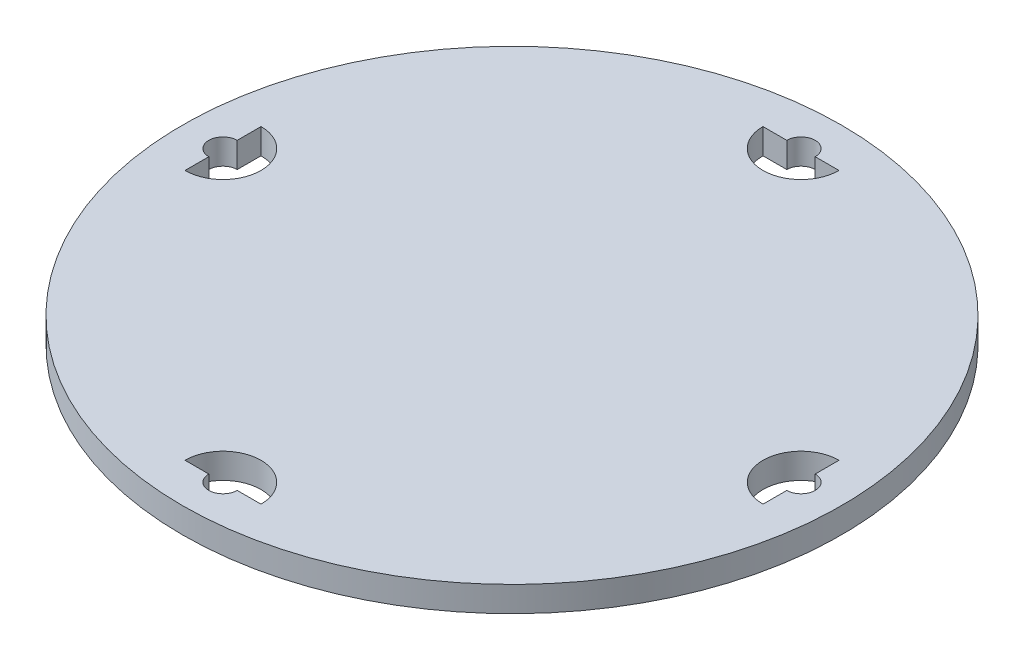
ISO-10303-21;
HEADER;
FILE_DESCRIPTION(('STEP AP214'),'2;1');
FILE_NAME('part.step','',(''),(''),'','','');
FILE_SCHEMA(('AUTOMOTIVE_DESIGN { 1 0 10303 214 1 1 1 1 }'));
ENDSEC;
DATA;
#1=APPLICATION_CONTEXT('core data for automotive mechanical design processes');
#2=APPLICATION_PROTOCOL_DEFINITION('international standard','automotive_design',2000,#1);
#3=PRODUCT_CONTEXT('',#1,'mechanical');
#4=PRODUCT('Part','Part','',(#3));
#5=PRODUCT_RELATED_PRODUCT_CATEGORY('part','',(#4));
#6=PRODUCT_DEFINITION_FORMATION('','',#4);
#7=PRODUCT_DEFINITION_CONTEXT('part definition',#1,'design');
#8=PRODUCT_DEFINITION('design','',#6,#7);
#9=PRODUCT_DEFINITION_SHAPE('','',#8);
#10=(LENGTH_UNIT() NAMED_UNIT(*) SI_UNIT(.MILLI.,.METRE.));
#11=(NAMED_UNIT(*) PLANE_ANGLE_UNIT() SI_UNIT($,.RADIAN.));
#12=(NAMED_UNIT(*) SI_UNIT($,.STERADIAN.) SOLID_ANGLE_UNIT());
#13=UNCERTAINTY_MEASURE_WITH_UNIT(LENGTH_MEASURE(1.E-05),#10,'distance_accuracy_value','');
#14=(GEOMETRIC_REPRESENTATION_CONTEXT(3) GLOBAL_UNCERTAINTY_ASSIGNED_CONTEXT((#13)) GLOBAL_UNIT_ASSIGNED_CONTEXT((#10,
#11,#12)) REPRESENTATION_CONTEXT('',''));
#15=CARTESIAN_POINT('',(0.,0.,0.));
#16=DIRECTION('',(0.,0.,1.));
#17=DIRECTION('',(1.,0.,0.));
#18=AXIS2_PLACEMENT_3D('',#15,#16,#17);
#19=CARTESIAN_POINT('',(0.,6.35,0.));
#20=DIRECTION('',(0.,1.,0.));
#21=DIRECTION('',(0.,0.,1.));
#22=AXIS2_PLACEMENT_3D('',#19,#20,#21);
#23=PLANE('',#22);
#24=DIRECTION('',(1.,0.,0.));
#25=VECTOR('',#24,1.);
#26=CARTESIAN_POINT('',(1.68305086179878E-13,6.35,-72.39));
#27=LINE('',#26,#25);
#28=CARTESIAN_POINT('',(3.556,6.35,-72.39));
#29=VERTEX_POINT('',#28);
#30=CARTESIAN_POINT('',(9.525,6.35,-72.39));
#31=VERTEX_POINT('',#30);
#32=EDGE_CURVE('E81',#29,#31,#27,.T.);
#33=ORIENTED_EDGE('',*,*,#32,.T.);
#34=CARTESIAN_POINT('',(0.,6.35,-72.39));
#35=DIRECTION('',(0.,1.,0.));
#36=DIRECTION('',(0.,0.,-1.));
#37=AXIS2_PLACEMENT_3D('',#34,#35,#36);
#38=CIRCLE('',#37,9.525);
#39=CARTESIAN_POINT('',(-9.525,6.35,-72.39));
#40=VERTEX_POINT('',#39);
#41=EDGE_CURVE('E233',#31,#40,#38,.F.);
#42=ORIENTED_EDGE('',*,*,#41,.T.);
#43=DIRECTION('',(-1.,0.,0.));
#44=VECTOR('',#43,1.);
#45=CARTESIAN_POINT('',(-1.68305086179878E-13,6.35,-72.39));
#46=LINE('',#45,#44);
#47=CARTESIAN_POINT('',(-3.556,6.35,-72.39));
#48=VERTEX_POINT('',#47);
#49=EDGE_CURVE('E221',#48,#40,#46,.T.);
#50=ORIENTED_EDGE('',*,*,#49,.F.);
#51=CARTESIAN_POINT('',(0.,6.35,-72.39));
#52=DIRECTION('',(0.,1.,0.));
#53=DIRECTION('',(0.,0.,-1.));
#54=AXIS2_PLACEMENT_3D('',#51,#52,#53);
#55=CIRCLE('',#54,3.556);
#56=EDGE_CURVE('E210',#29,#48,#55,.T.);
#57=ORIENTED_EDGE('',*,*,#56,.F.);
#58=EDGE_LOOP('',(#33,#42,#50,#57));
#59=FACE_BOUND('',#58,.T.);
#60=CARTESIAN_POINT('',(0.,6.35,72.39));
#61=DIRECTION('',(0.,1.,0.));
#62=DIRECTION('',(0.,0.,1.));
#63=AXIS2_PLACEMENT_3D('',#60,#61,#62);
#64=CIRCLE('',#63,9.525);
#65=CARTESIAN_POINT('',(-9.525,6.35,72.39));
#66=VERTEX_POINT('',#65);
#67=CARTESIAN_POINT('',(9.525,6.35,72.39));
#68=VERTEX_POINT('',#67);
#69=EDGE_CURVE('E274',#66,#68,#64,.F.);
#70=ORIENTED_EDGE('',*,*,#69,.T.);
#71=DIRECTION('',(1.,0.,0.));
#72=VECTOR('',#71,1.);
#73=CARTESIAN_POINT('',(1.68305086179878E-13,6.35,72.39));
#74=LINE('',#73,#72);
#75=CARTESIAN_POINT('',(3.556,6.35,72.39));
#76=VERTEX_POINT('',#75);
#77=EDGE_CURVE('E296',#76,#68,#74,.T.);
#78=ORIENTED_EDGE('',*,*,#77,.F.);
#79=CARTESIAN_POINT('',(0.,6.35,72.39));
#80=DIRECTION('',(0.,1.,0.));
#81=DIRECTION('',(0.,0.,1.));
#82=AXIS2_PLACEMENT_3D('',#79,#80,#81);
#83=CIRCLE('',#82,3.556);
#84=CARTESIAN_POINT('',(-3.556,6.35,72.39));
#85=VERTEX_POINT('',#84);
#86=EDGE_CURVE('E275',#85,#76,#83,.T.);
#87=ORIENTED_EDGE('',*,*,#86,.F.);
#88=DIRECTION('',(-1.,0.,0.));
#89=VECTOR('',#88,1.);
#90=CARTESIAN_POINT('',(-1.68305086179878E-13,6.35,72.39));
#91=LINE('',#90,#89);
#92=EDGE_CURVE('E271',#85,#66,#91,.T.);
#93=ORIENTED_EDGE('',*,*,#92,.T.);
#94=EDGE_LOOP('',(#70,#78,#87,#93));
#95=FACE_BOUND('',#94,.T.);
#96=CARTESIAN_POINT('',(0.,6.35,0.));
#97=DIRECTION('',(0.,1.,0.));
#98=DIRECTION('',(0.,0.,1.));
#99=AXIS2_PLACEMENT_3D('',#96,#97,#98);
#100=CIRCLE('',#99,82.55);
#101=CARTESIAN_POINT('',(0.,6.35,82.55));
#102=VERTEX_POINT('',#101);
#103=EDGE_CURVE('E12',#102,#102,#100,.T.);
#104=ORIENTED_EDGE('',*,*,#103,.T.);
#105=EDGE_LOOP('',(#104));
#106=FACE_BOUND('',#105,.T.);
#107=DIRECTION('',(0.,0.,-1.));
#108=VECTOR('',#107,1.);
#109=CARTESIAN_POINT('',(-72.39,6.35,5.89939916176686E-13));
#110=LINE('',#109,#108);
#111=CARTESIAN_POINT('',(-72.3900000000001,6.35,-3.55599999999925));
#112=VERTEX_POINT('',#111);
#113=CARTESIAN_POINT('',(-72.3900000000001,6.35,-9.52499999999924));
#114=VERTEX_POINT('',#113);
#115=EDGE_CURVE('E213',#112,#114,#110,.T.);
#116=ORIENTED_EDGE('',*,*,#115,.T.);
#117=CARTESIAN_POINT('',(-72.39,6.35,7.58245002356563E-13));
#118=DIRECTION('',(0.,1.,0.));
#119=DIRECTION('',(-1.,0.,0.));
#120=AXIS2_PLACEMENT_3D('',#117,#118,#119);
#121=CIRCLE('',#120,9.525);
#122=CARTESIAN_POINT('',(-72.3899999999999,6.35,9.52500000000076));
#123=VERTEX_POINT('',#122);
#124=EDGE_CURVE('E263',#114,#123,#121,.F.);
#125=ORIENTED_EDGE('',*,*,#124,.T.);
#126=DIRECTION('',(0.,0.,1.));
#127=VECTOR('',#126,1.);
#128=CARTESIAN_POINT('',(-72.39,6.35,9.26550088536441E-13));
#129=LINE('',#128,#127);
#130=CARTESIAN_POINT('',(-72.39,6.35,3.55600000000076));
#131=VERTEX_POINT('',#130);
#132=EDGE_CURVE('E251',#131,#123,#129,.T.);
#133=ORIENTED_EDGE('',*,*,#132,.F.);
#134=CARTESIAN_POINT('',(-72.39,6.35,7.58245002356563E-13));
#135=DIRECTION('',(0.,1.,0.));
#136=DIRECTION('',(-1.,0.,0.));
#137=AXIS2_PLACEMENT_3D('',#134,#135,#136);
#138=CIRCLE('',#137,3.556);
#139=EDGE_CURVE('E240',#112,#131,#138,.T.);
#140=ORIENTED_EDGE('',*,*,#139,.F.);
#141=EDGE_LOOP('',(#116,#125,#133,#140));
#142=FACE_BOUND('',#141,.T.);
#143=DIRECTION('',(0.,0.,1.));
#144=VECTOR('',#143,1.);
#145=CARTESIAN_POINT('',(72.39,6.35,0.));
#146=LINE('',#145,#144);
#147=CARTESIAN_POINT('',(72.39,6.35,3.55599999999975));
#148=VERTEX_POINT('',#147);
#149=CARTESIAN_POINT('',(72.39,6.35,9.52499999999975));
#150=VERTEX_POINT('',#149);
#151=EDGE_CURVE('E73',#148,#150,#146,.T.);
#152=ORIENTED_EDGE('',*,*,#151,.T.);
#153=CARTESIAN_POINT('',(72.39,6.35,-2.52748334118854E-13));
#154=DIRECTION('',(0.,1.,0.));
#155=DIRECTION('',(1.,0.,0.));
#156=AXIS2_PLACEMENT_3D('',#153,#154,#155);
#157=CIRCLE('',#156,9.525);
#158=CARTESIAN_POINT('',(72.39,6.35,-9.52500000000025));
#159=VERTEX_POINT('',#158);
#160=EDGE_CURVE('E192',#150,#159,#157,.F.);
#161=ORIENTED_EDGE('',*,*,#160,.T.);
#162=DIRECTION('',(0.,0.,-1.));
#163=VECTOR('',#162,1.);
#164=CARTESIAN_POINT('',(72.39,6.35,-4.21053420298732E-13));
#165=LINE('',#164,#163);
#166=CARTESIAN_POINT('',(72.39,6.35,-3.55600000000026));
#167=VERTEX_POINT('',#166);
#168=EDGE_CURVE('E185',#167,#159,#165,.T.);
#169=ORIENTED_EDGE('',*,*,#168,.F.);
#170=CARTESIAN_POINT('',(72.39,6.35,-2.52748334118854E-13));
#171=DIRECTION('',(0.,1.,0.));
#172=DIRECTION('',(1.,0.,0.));
#173=AXIS2_PLACEMENT_3D('',#170,#171,#172);
#174=CIRCLE('',#173,3.556);
#175=EDGE_CURVE('E173',#148,#167,#174,.T.);
#176=ORIENTED_EDGE('',*,*,#175,.F.);
#177=EDGE_LOOP('',(#152,#161,#169,#176));
#178=FACE_BOUND('',#177,.T.);
#179=ADVANCED_FACE('F58',(#59,#95,#106,#142,#178),#23,.T.);
#180=CARTESIAN_POINT('',(0.,0.,0.));
#181=DIRECTION('',(0.,1.,0.));
#182=DIRECTION('',(0.,0.,1.));
#183=AXIS2_PLACEMENT_3D('',#180,#181,#182);
#184=PLANE('',#183);
#185=CARTESIAN_POINT('',(0.,0.,0.));
#186=DIRECTION('',(0.,1.,0.));
#187=DIRECTION('',(0.,0.,1.));
#188=AXIS2_PLACEMENT_3D('',#185,#186,#187);
#189=CIRCLE('',#188,82.55);
#190=CARTESIAN_POINT('',(0.,0.,82.55));
#191=VERTEX_POINT('',#190);
#192=EDGE_CURVE('E62',#191,#191,#189,.T.);
#193=ORIENTED_EDGE('',*,*,#192,.F.);
#194=EDGE_LOOP('',(#193));
#195=FACE_BOUND('',#194,.T.);
#196=DIRECTION('',(1.,0.,0.));
#197=VECTOR('',#196,1.);
#198=CARTESIAN_POINT('',(1.68305086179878E-13,0.,72.39));
#199=LINE('',#198,#197);
#200=CARTESIAN_POINT('',(3.556,0.,72.39));
#201=VERTEX_POINT('',#200);
#202=CARTESIAN_POINT('',(9.525,0.,72.39));
#203=VERTEX_POINT('',#202);
#204=EDGE_CURVE('E284',#201,#203,#199,.T.);
#205=ORIENTED_EDGE('',*,*,#204,.T.);
#206=CARTESIAN_POINT('',(0.,0.,72.39));
#207=DIRECTION('',(0.,1.,0.));
#208=DIRECTION('',(0.,0.,1.));
#209=AXIS2_PLACEMENT_3D('',#206,#207,#208);
#210=CIRCLE('',#209,9.525);
#211=CARTESIAN_POINT('',(-9.525,0.,72.39));
#212=VERTEX_POINT('',#211);
#213=EDGE_CURVE('E278',#212,#203,#210,.F.);
#214=ORIENTED_EDGE('',*,*,#213,.F.);
#215=DIRECTION('',(-1.,0.,0.));
#216=VECTOR('',#215,1.);
#217=CARTESIAN_POINT('',(-1.68305086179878E-13,0.,72.39));
#218=LINE('',#217,#216);
#219=CARTESIAN_POINT('',(-3.556,0.,72.39));
#220=VERTEX_POINT('',#219);
#221=EDGE_CURVE('E281',#220,#212,#218,.T.);
#222=ORIENTED_EDGE('',*,*,#221,.F.);
#223=CARTESIAN_POINT('',(0.,0.,72.39));
#224=DIRECTION('',(0.,1.,0.));
#225=DIRECTION('',(0.,0.,1.));
#226=AXIS2_PLACEMENT_3D('',#223,#224,#225);
#227=CIRCLE('',#226,3.556);
#228=EDGE_CURVE('E209',#220,#201,#227,.T.);
#229=ORIENTED_EDGE('',*,*,#228,.T.);
#230=EDGE_LOOP('',(#205,#214,#222,#229));
#231=FACE_BOUND('',#230,.T.);
#232=CARTESIAN_POINT('',(-72.39,0.,7.58245002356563E-13));
#233=DIRECTION('',(0.,1.,0.));
#234=DIRECTION('',(-1.,0.,0.));
#235=AXIS2_PLACEMENT_3D('',#232,#233,#234);
#236=CIRCLE('',#235,9.525);
#237=CARTESIAN_POINT('',(-72.3900000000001,0.,-9.52499999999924));
#238=VERTEX_POINT('',#237);
#239=CARTESIAN_POINT('',(-72.3899999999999,0.,9.52500000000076));
#240=VERTEX_POINT('',#239);
#241=EDGE_CURVE('E260',#238,#240,#236,.F.);
#242=ORIENTED_EDGE('',*,*,#241,.F.);
#243=DIRECTION('',(0.,0.,-1.));
#244=VECTOR('',#243,1.);
#245=CARTESIAN_POINT('',(-72.39,0.,5.89939916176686E-13));
#246=LINE('',#245,#244);
#247=CARTESIAN_POINT('',(-72.3900000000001,0.,-3.55599999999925));
#248=VERTEX_POINT('',#247);
#249=EDGE_CURVE('E266',#248,#238,#246,.T.);
#250=ORIENTED_EDGE('',*,*,#249,.F.);
#251=CARTESIAN_POINT('',(-72.39,0.,7.58245002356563E-13));
#252=DIRECTION('',(0.,1.,0.));
#253=DIRECTION('',(-1.,0.,0.));
#254=AXIS2_PLACEMENT_3D('',#251,#252,#253);
#255=CIRCLE('',#254,3.556);
#256=CARTESIAN_POINT('',(-72.39,0.,3.55600000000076));
#257=VERTEX_POINT('',#256);
#258=EDGE_CURVE('E242',#248,#257,#255,.T.);
#259=ORIENTED_EDGE('',*,*,#258,.T.);
#260=DIRECTION('',(0.,0.,1.));
#261=VECTOR('',#260,1.);
#262=CARTESIAN_POINT('',(-72.39,0.,9.26550088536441E-13));
#263=LINE('',#262,#261);
#264=EDGE_CURVE('E255',#257,#240,#263,.T.);
#265=ORIENTED_EDGE('',*,*,#264,.T.);
#266=EDGE_LOOP('',(#242,#250,#259,#265));
#267=FACE_BOUND('',#266,.T.);
#268=CARTESIAN_POINT('',(0.,0.,-72.39));
#269=DIRECTION('',(0.,1.,0.));
#270=DIRECTION('',(0.,0.,-1.));
#271=AXIS2_PLACEMENT_3D('',#268,#269,#270);
#272=CIRCLE('',#271,9.525);
#273=CARTESIAN_POINT('',(9.525,0.,-72.39));
#274=VERTEX_POINT('',#273);
#275=CARTESIAN_POINT('',(-9.525,0.,-72.39));
#276=VERTEX_POINT('',#275);
#277=EDGE_CURVE('E230',#274,#276,#272,.F.);
#278=ORIENTED_EDGE('',*,*,#277,.F.);
#279=DIRECTION('',(1.,0.,0.));
#280=VECTOR('',#279,1.);
#281=CARTESIAN_POINT('',(1.68305086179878E-13,0.,-72.39));
#282=LINE('',#281,#280);
#283=CARTESIAN_POINT('',(3.556,0.,-72.39));
#284=VERTEX_POINT('',#283);
#285=EDGE_CURVE('E236',#284,#274,#282,.T.);
#286=ORIENTED_EDGE('',*,*,#285,.F.);
#287=CARTESIAN_POINT('',(0.,0.,-72.39));
#288=DIRECTION('',(0.,1.,0.));
#289=DIRECTION('',(0.,0.,-1.));
#290=AXIS2_PLACEMENT_3D('',#287,#288,#289);
#291=CIRCLE('',#290,3.556);
#292=CARTESIAN_POINT('',(-3.556,0.,-72.39));
#293=VERTEX_POINT('',#292);
#294=EDGE_CURVE('E212',#284,#293,#291,.T.);
#295=ORIENTED_EDGE('',*,*,#294,.T.);
#296=DIRECTION('',(-1.,0.,0.));
#297=VECTOR('',#296,1.);
#298=CARTESIAN_POINT('',(-1.68305086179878E-13,0.,-72.39));
#299=LINE('',#298,#297);
#300=EDGE_CURVE('E225',#293,#276,#299,.T.);
#301=ORIENTED_EDGE('',*,*,#300,.T.);
#302=EDGE_LOOP('',(#278,#286,#295,#301));
#303=FACE_BOUND('',#302,.T.);
#304=CARTESIAN_POINT('',(72.39,0.,-2.52748334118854E-13));
#305=DIRECTION('',(0.,1.,0.));
#306=DIRECTION('',(1.,0.,0.));
#307=AXIS2_PLACEMENT_3D('',#304,#305,#306);
#308=CIRCLE('',#307,9.525);
#309=CARTESIAN_POINT('',(72.39,0.,9.52499999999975));
#310=VERTEX_POINT('',#309);
#311=CARTESIAN_POINT('',(72.39,0.,-9.52500000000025));
#312=VERTEX_POINT('',#311);
#313=EDGE_CURVE('E201',#310,#312,#308,.F.);
#314=ORIENTED_EDGE('',*,*,#313,.F.);
#315=DIRECTION('',(0.,0.,1.));
#316=VECTOR('',#315,1.);
#317=CARTESIAN_POINT('',(72.39,0.,0.));
#318=LINE('',#317,#316);
#319=CARTESIAN_POINT('',(72.39,0.,3.55599999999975));
#320=VERTEX_POINT('',#319);
#321=EDGE_CURVE('E205',#320,#310,#318,.T.);
#322=ORIENTED_EDGE('',*,*,#321,.F.);
#323=CARTESIAN_POINT('',(72.39,0.,-2.52748334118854E-13));
#324=DIRECTION('',(0.,1.,0.));
#325=DIRECTION('',(1.,0.,0.));
#326=AXIS2_PLACEMENT_3D('',#323,#324,#325);
#327=CIRCLE('',#326,3.556);
#328=CARTESIAN_POINT('',(72.39,0.,-3.55600000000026));
#329=VERTEX_POINT('',#328);
#330=EDGE_CURVE('E181',#320,#329,#327,.T.);
#331=ORIENTED_EDGE('',*,*,#330,.T.);
#332=DIRECTION('',(0.,0.,-1.));
#333=VECTOR('',#332,1.);
#334=CARTESIAN_POINT('',(72.39,0.,-4.21053420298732E-13));
#335=LINE('',#334,#333);
#336=EDGE_CURVE('E188',#329,#312,#335,.T.);
#337=ORIENTED_EDGE('',*,*,#336,.T.);
#338=EDGE_LOOP('',(#314,#322,#331,#337));
#339=FACE_BOUND('',#338,.T.);
#340=ADVANCED_FACE('F315',(#195,#231,#267,#303,#339),#184,.F.);
#341=CARTESIAN_POINT('',(0.,6.35,0.));
#342=DIRECTION('',(0.,-1.,0.));
#343=DIRECTION('',(0.,0.,-1.));
#344=AXIS2_PLACEMENT_3D('',#341,#342,#343);
#345=CYLINDRICAL_SURFACE('',#344,82.55);
#346=ORIENTED_EDGE('',*,*,#103,.F.);
#347=EDGE_LOOP('',(#346));
#348=FACE_BOUND('',#347,.T.);
#349=ORIENTED_EDGE('',*,*,#192,.T.);
#350=EDGE_LOOP('',(#349));
#351=FACE_BOUND('',#350,.T.);
#352=ADVANCED_FACE('F60',(#348,#351),#345,.T.);
#353=CARTESIAN_POINT('',(0.,6.351,72.39));
#354=DIRECTION('',(0.,-1.,0.));
#355=DIRECTION('',(0.,0.,-1.));
#356=AXIS2_PLACEMENT_3D('',#353,#354,#355);
#357=CYLINDRICAL_SURFACE('',#356,9.525);
#358=DIRECTION('',(0.,-1.,0.));
#359=VECTOR('',#358,1.);
#360=CARTESIAN_POINT('',(-9.525,6.351,72.39));
#361=LINE('',#360,#359);
#362=EDGE_CURVE('E294',#66,#212,#361,.T.);
#363=ORIENTED_EDGE('',*,*,#362,.T.);
#364=ORIENTED_EDGE('',*,*,#213,.T.);
#365=DIRECTION('',(0.,-1.,0.));
#366=VECTOR('',#365,1.);
#367=CARTESIAN_POINT('',(9.525,6.351,72.39));
#368=LINE('',#367,#366);
#369=EDGE_CURVE('E287',#68,#203,#368,.T.);
#370=ORIENTED_EDGE('',*,*,#369,.F.);
#371=ORIENTED_EDGE('',*,*,#69,.F.);
#372=EDGE_LOOP('',(#363,#364,#370,#371));
#373=FACE_BOUND('',#372,.T.);
#374=ADVANCED_FACE('F321',(#373),#357,.F.);
#375=CARTESIAN_POINT('',(-1.68305086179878E-13,6.351,72.39));
#376=DIRECTION('',(0.,0.,1.));
#377=DIRECTION('',(1.,0.,0.));
#378=AXIS2_PLACEMENT_3D('',#375,#376,#377);
#379=PLANE('',#378);
#380=DIRECTION('',(0.,-1.,0.));
#381=VECTOR('',#380,1.);
#382=CARTESIAN_POINT('',(-3.556,6.351,72.39));
#383=LINE('',#382,#381);
#384=EDGE_CURVE('E292',#85,#220,#383,.T.);
#385=ORIENTED_EDGE('',*,*,#384,.T.);
#386=ORIENTED_EDGE('',*,*,#221,.T.);
#387=ORIENTED_EDGE('',*,*,#362,.F.);
#388=ORIENTED_EDGE('',*,*,#92,.F.);
#389=EDGE_LOOP('',(#385,#386,#387,#388));
#390=FACE_BOUND('',#389,.T.);
#391=ADVANCED_FACE('F319',(#390),#379,.F.);
#392=CARTESIAN_POINT('',(1.68305086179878E-13,6.351,72.39));
#393=DIRECTION('',(0.,0.,-1.));
#394=DIRECTION('',(-1.,0.,0.));
#395=AXIS2_PLACEMENT_3D('',#392,#393,#394);
#396=PLANE('',#395);
#397=ORIENTED_EDGE('',*,*,#77,.T.);
#398=ORIENTED_EDGE('',*,*,#369,.T.);
#399=ORIENTED_EDGE('',*,*,#204,.F.);
#400=DIRECTION('',(0.,-1.,0.));
#401=VECTOR('',#400,1.);
#402=CARTESIAN_POINT('',(3.556,6.351,72.39));
#403=LINE('',#402,#401);
#404=EDGE_CURVE('E289',#76,#201,#403,.T.);
#405=ORIENTED_EDGE('',*,*,#404,.F.);
#406=EDGE_LOOP('',(#397,#398,#399,#405));
#407=FACE_BOUND('',#406,.T.);
#408=ADVANCED_FACE('F312',(#407),#396,.T.);
#409=CARTESIAN_POINT('',(0.,6.351,72.39));
#410=DIRECTION('',(0.,-1.,0.));
#411=DIRECTION('',(0.,0.,-1.));
#412=AXIS2_PLACEMENT_3D('',#409,#410,#411);
#413=CYLINDRICAL_SURFACE('',#412,3.556);
#414=ORIENTED_EDGE('',*,*,#384,.F.);
#415=ORIENTED_EDGE('',*,*,#86,.T.);
#416=ORIENTED_EDGE('',*,*,#404,.T.);
#417=ORIENTED_EDGE('',*,*,#228,.F.);
#418=EDGE_LOOP('',(#414,#415,#416,#417));
#419=FACE_BOUND('',#418,.T.);
#420=ADVANCED_FACE('F306',(#419),#413,.F.);
#421=CARTESIAN_POINT('',(-72.39,6.351,5.89939916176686E-13));
#422=DIRECTION('',(-1.,0.,0.));
#423=DIRECTION('',(0.,0.,1.));
#424=AXIS2_PLACEMENT_3D('',#421,#422,#423);
#425=PLANE('',#424);
#426=DIRECTION('',(0.,-1.,0.));
#427=VECTOR('',#426,1.);
#428=CARTESIAN_POINT('',(-72.3900000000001,6.351,-3.55599999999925));
#429=LINE('',#428,#427);
#430=EDGE_CURVE('E245',#112,#248,#429,.T.);
#431=ORIENTED_EDGE('',*,*,#430,.T.);
#432=ORIENTED_EDGE('',*,*,#249,.T.);
#433=DIRECTION('',(0.,-1.,0.));
#434=VECTOR('',#433,1.);
#435=CARTESIAN_POINT('',(-72.3900000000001,6.351,-9.52499999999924));
#436=LINE('',#435,#434);
#437=EDGE_CURVE('E258',#114,#238,#436,.T.);
#438=ORIENTED_EDGE('',*,*,#437,.F.);
#439=ORIENTED_EDGE('',*,*,#115,.F.);
#440=EDGE_LOOP('',(#431,#432,#438,#439));
#441=FACE_BOUND('',#440,.T.);
#442=ADVANCED_FACE('F332',(#441),#425,.F.);
#443=CARTESIAN_POINT('',(-72.39,6.351,7.58245002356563E-13));
#444=DIRECTION('',(0.,-1.,0.));
#445=DIRECTION('',(1.,0.,0.));
#446=AXIS2_PLACEMENT_3D('',#443,#444,#445);
#447=CYLINDRICAL_SURFACE('',#446,9.525);
#448=ORIENTED_EDGE('',*,*,#437,.T.);
#449=ORIENTED_EDGE('',*,*,#241,.T.);
#450=DIRECTION('',(0.,-1.,0.));
#451=VECTOR('',#450,1.);
#452=CARTESIAN_POINT('',(-72.3899999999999,6.351,9.52500000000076));
#453=LINE('',#452,#451);
#454=EDGE_CURVE('E253',#123,#240,#453,.T.);
#455=ORIENTED_EDGE('',*,*,#454,.F.);
#456=ORIENTED_EDGE('',*,*,#124,.F.);
#457=EDGE_LOOP('',(#448,#449,#455,#456));
#458=FACE_BOUND('',#457,.T.);
#459=ADVANCED_FACE('F373',(#458),#447,.F.);
#460=CARTESIAN_POINT('',(-72.39,6.351,9.26550088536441E-13));
#461=DIRECTION('',(1.,0.,0.));
#462=DIRECTION('',(0.,0.,-1.));
#463=AXIS2_PLACEMENT_3D('',#460,#461,#462);
#464=PLANE('',#463);
#465=ORIENTED_EDGE('',*,*,#132,.T.);
#466=ORIENTED_EDGE('',*,*,#454,.T.);
#467=ORIENTED_EDGE('',*,*,#264,.F.);
#468=DIRECTION('',(0.,-1.,0.));
#469=VECTOR('',#468,1.);
#470=CARTESIAN_POINT('',(-72.39,6.351,3.55600000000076));
#471=LINE('',#470,#469);
#472=EDGE_CURVE('E248',#131,#257,#471,.T.);
#473=ORIENTED_EDGE('',*,*,#472,.F.);
#474=EDGE_LOOP('',(#465,#466,#467,#473));
#475=FACE_BOUND('',#474,.T.);
#476=ADVANCED_FACE('F369',(#475),#464,.T.);
#477=CARTESIAN_POINT('',(-72.39,6.351,7.58245002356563E-13));
#478=DIRECTION('',(0.,-1.,0.));
#479=DIRECTION('',(1.,0.,0.));
#480=AXIS2_PLACEMENT_3D('',#477,#478,#479);
#481=CYLINDRICAL_SURFACE('',#480,3.556);
#482=ORIENTED_EDGE('',*,*,#430,.F.);
#483=ORIENTED_EDGE('',*,*,#139,.T.);
#484=ORIENTED_EDGE('',*,*,#472,.T.);
#485=ORIENTED_EDGE('',*,*,#258,.F.);
#486=EDGE_LOOP('',(#482,#483,#484,#485));
#487=FACE_BOUND('',#486,.T.);
#488=ADVANCED_FACE('F363',(#487),#481,.F.);
#489=CARTESIAN_POINT('',(1.68305086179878E-13,6.351,-72.39));
#490=DIRECTION('',(0.,0.,-1.));
#491=DIRECTION('',(-1.,0.,0.));
#492=AXIS2_PLACEMENT_3D('',#489,#490,#491);
#493=PLANE('',#492);
#494=DIRECTION('',(0.,-1.,0.));
#495=VECTOR('',#494,1.);
#496=CARTESIAN_POINT('',(3.556,6.351,-72.39));
#497=LINE('',#496,#495);
#498=EDGE_CURVE('E216',#29,#284,#497,.T.);
#499=ORIENTED_EDGE('',*,*,#498,.T.);
#500=ORIENTED_EDGE('',*,*,#285,.T.);
#501=DIRECTION('',(0.,-1.,0.));
#502=VECTOR('',#501,1.);
#503=CARTESIAN_POINT('',(9.525,6.351,-72.39));
#504=LINE('',#503,#502);
#505=EDGE_CURVE('E228',#31,#274,#504,.T.);
#506=ORIENTED_EDGE('',*,*,#505,.F.);
#507=ORIENTED_EDGE('',*,*,#32,.F.);
#508=EDGE_LOOP('',(#499,#500,#506,#507));
#509=FACE_BOUND('',#508,.T.);
#510=ADVANCED_FACE('F353',(#509),#493,.F.);
#511=CARTESIAN_POINT('',(0.,6.351,-72.39));
#512=DIRECTION('',(0.,-1.,0.));
#513=DIRECTION('',(0.,0.,1.));
#514=AXIS2_PLACEMENT_3D('',#511,#512,#513);
#515=CYLINDRICAL_SURFACE('',#514,9.525);
#516=ORIENTED_EDGE('',*,*,#505,.T.);
#517=ORIENTED_EDGE('',*,*,#277,.T.);
#518=DIRECTION('',(0.,-1.,0.));
#519=VECTOR('',#518,1.);
#520=CARTESIAN_POINT('',(-9.525,6.351,-72.39));
#521=LINE('',#520,#519);
#522=EDGE_CURVE('E223',#40,#276,#521,.T.);
#523=ORIENTED_EDGE('',*,*,#522,.F.);
#524=ORIENTED_EDGE('',*,*,#41,.F.);
#525=EDGE_LOOP('',(#516,#517,#523,#524));
#526=FACE_BOUND('',#525,.T.);
#527=ADVANCED_FACE('F355',(#526),#515,.F.);
#528=CARTESIAN_POINT('',(-1.68305086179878E-13,6.351,-72.39));
#529=DIRECTION('',(0.,0.,1.));
#530=DIRECTION('',(1.,0.,0.));
#531=AXIS2_PLACEMENT_3D('',#528,#529,#530);
#532=PLANE('',#531);
#533=ORIENTED_EDGE('',*,*,#49,.T.);
#534=ORIENTED_EDGE('',*,*,#522,.T.);
#535=ORIENTED_EDGE('',*,*,#300,.F.);
#536=DIRECTION('',(0.,-1.,0.));
#537=VECTOR('',#536,1.);
#538=CARTESIAN_POINT('',(-3.556,6.351,-72.39));
#539=LINE('',#538,#537);
#540=EDGE_CURVE('E218',#48,#293,#539,.T.);
#541=ORIENTED_EDGE('',*,*,#540,.F.);
#542=EDGE_LOOP('',(#533,#534,#535,#541));
#543=FACE_BOUND('',#542,.T.);
#544=ADVANCED_FACE('F347',(#543),#532,.T.);
#545=CARTESIAN_POINT('',(0.,6.351,-72.39));
#546=DIRECTION('',(0.,-1.,0.));
#547=DIRECTION('',(0.,0.,1.));
#548=AXIS2_PLACEMENT_3D('',#545,#546,#547);
#549=CYLINDRICAL_SURFACE('',#548,3.556);
#550=ORIENTED_EDGE('',*,*,#498,.F.);
#551=ORIENTED_EDGE('',*,*,#56,.T.);
#552=ORIENTED_EDGE('',*,*,#540,.T.);
#553=ORIENTED_EDGE('',*,*,#294,.F.);
#554=EDGE_LOOP('',(#550,#551,#552,#553));
#555=FACE_BOUND('',#554,.T.);
#556=ADVANCED_FACE('F345',(#555),#549,.F.);
#557=CARTESIAN_POINT('',(72.39,6.351,0.));
#558=DIRECTION('',(1.,0.,0.));
#559=DIRECTION('',(0.,0.,-1.));
#560=AXIS2_PLACEMENT_3D('',#557,#558,#559);
#561=PLANE('',#560);
#562=DIRECTION('',(0.,-1.,0.));
#563=VECTOR('',#562,1.);
#564=CARTESIAN_POINT('',(72.39,6.351,3.55599999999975));
#565=LINE('',#564,#563);
#566=EDGE_CURVE('E178',#148,#320,#565,.T.);
#567=ORIENTED_EDGE('',*,*,#566,.T.);
#568=ORIENTED_EDGE('',*,*,#321,.T.);
#569=DIRECTION('',(0.,-1.,0.));
#570=VECTOR('',#569,1.);
#571=CARTESIAN_POINT('',(72.39,6.351,9.52499999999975));
#572=LINE('',#571,#570);
#573=EDGE_CURVE('E199',#150,#310,#572,.T.);
#574=ORIENTED_EDGE('',*,*,#573,.F.);
#575=ORIENTED_EDGE('',*,*,#151,.F.);
#576=EDGE_LOOP('',(#567,#568,#574,#575));
#577=FACE_BOUND('',#576,.T.);
#578=ADVANCED_FACE('F430',(#577),#561,.F.);
#579=CARTESIAN_POINT('',(72.39,6.351,-2.52748334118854E-13));
#580=DIRECTION('',(0.,-1.,0.));
#581=DIRECTION('',(-1.,0.,0.));
#582=AXIS2_PLACEMENT_3D('',#579,#580,#581);
#583=CYLINDRICAL_SURFACE('',#582,9.525);
#584=ORIENTED_EDGE('',*,*,#573,.T.);
#585=ORIENTED_EDGE('',*,*,#313,.T.);
#586=DIRECTION('',(0.,-1.,0.));
#587=VECTOR('',#586,1.);
#588=CARTESIAN_POINT('',(72.39,6.351,-9.52500000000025));
#589=LINE('',#588,#587);
#590=EDGE_CURVE('E193',#159,#312,#589,.T.);
#591=ORIENTED_EDGE('',*,*,#590,.F.);
#592=ORIENTED_EDGE('',*,*,#160,.F.);
#593=EDGE_LOOP('',(#584,#585,#591,#592));
#594=FACE_BOUND('',#593,.T.);
#595=ADVANCED_FACE('F437',(#594),#583,.F.);
#596=CARTESIAN_POINT('',(72.39,6.351,-4.21053420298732E-13));
#597=DIRECTION('',(-1.,0.,0.));
#598=DIRECTION('',(0.,0.,1.));
#599=AXIS2_PLACEMENT_3D('',#596,#597,#598);
#600=PLANE('',#599);
#601=ORIENTED_EDGE('',*,*,#168,.T.);
#602=ORIENTED_EDGE('',*,*,#590,.T.);
#603=ORIENTED_EDGE('',*,*,#336,.F.);
#604=DIRECTION('',(0.,-1.,0.));
#605=VECTOR('',#604,1.);
#606=CARTESIAN_POINT('',(72.39,6.351,-3.55600000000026));
#607=LINE('',#606,#605);
#608=EDGE_CURVE('E176',#167,#329,#607,.T.);
#609=ORIENTED_EDGE('',*,*,#608,.F.);
#610=EDGE_LOOP('',(#601,#602,#603,#609));
#611=FACE_BOUND('',#610,.T.);
#612=ADVANCED_FACE('F184',(#611),#600,.T.);
#613=CARTESIAN_POINT('',(72.39,6.351,-2.52748334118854E-13));
#614=DIRECTION('',(0.,-1.,0.));
#615=DIRECTION('',(-1.,0.,0.));
#616=AXIS2_PLACEMENT_3D('',#613,#614,#615);
#617=CYLINDRICAL_SURFACE('',#616,3.556);
#618=ORIENTED_EDGE('',*,*,#566,.F.);
#619=ORIENTED_EDGE('',*,*,#175,.T.);
#620=ORIENTED_EDGE('',*,*,#608,.T.);
#621=ORIENTED_EDGE('',*,*,#330,.F.);
#622=EDGE_LOOP('',(#618,#619,#620,#621));
#623=FACE_BOUND('',#622,.T.);
#624=ADVANCED_FACE('F175',(#623),#617,.F.);
#625=CLOSED_SHELL('',(#179,#340,#352,#374,#391,#408,#420,#442,#459,#476,#488,#510,#527,#544,
#556,#578,#595,#612,#624));
#626=MANIFOLD_SOLID_BREP('B2',#625);
#627=ADVANCED_BREP_SHAPE_REPRESENTATION('',(#18,#626),#14);
#628=SHAPE_DEFINITION_REPRESENTATION(#9,#627);
ENDSEC;
END-ISO-10303-21;
